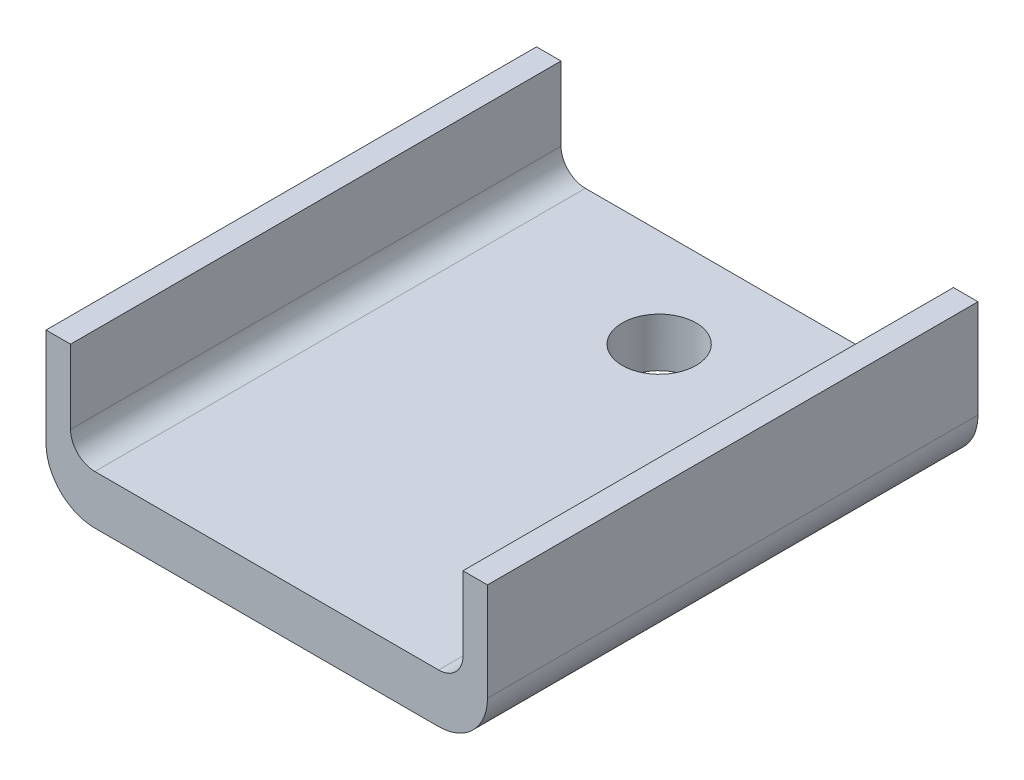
ISO-10303-21;
HEADER;
FILE_DESCRIPTION(('STEP AP214'),'2;1');
FILE_NAME('part.step','',(''),(''),'','','');
FILE_SCHEMA(('AUTOMOTIVE_DESIGN { 1 0 10303 214 1 1 1 1 }'));
ENDSEC;
DATA;
#1=APPLICATION_CONTEXT('core data for automotive mechanical design processes');
#2=APPLICATION_PROTOCOL_DEFINITION('international standard','automotive_design',2000,#1);
#3=PRODUCT_CONTEXT('',#1,'mechanical');
#4=PRODUCT('Part','Part','',(#3));
#5=PRODUCT_RELATED_PRODUCT_CATEGORY('part','',(#4));
#6=PRODUCT_DEFINITION_FORMATION('','',#4);
#7=PRODUCT_DEFINITION_CONTEXT('part definition',#1,'design');
#8=PRODUCT_DEFINITION('design','',#6,#7);
#9=PRODUCT_DEFINITION_SHAPE('','',#8);
#10=(LENGTH_UNIT() NAMED_UNIT(*) SI_UNIT(.MILLI.,.METRE.));
#11=(NAMED_UNIT(*) PLANE_ANGLE_UNIT() SI_UNIT($,.RADIAN.));
#12=(NAMED_UNIT(*) SI_UNIT($,.STERADIAN.) SOLID_ANGLE_UNIT());
#13=UNCERTAINTY_MEASURE_WITH_UNIT(LENGTH_MEASURE(1.E-05),#10,'distance_accuracy_value','');
#14=(GEOMETRIC_REPRESENTATION_CONTEXT(3) GLOBAL_UNCERTAINTY_ASSIGNED_CONTEXT((#13)) GLOBAL_UNIT_ASSIGNED_CONTEXT((#10,
#11,#12)) REPRESENTATION_CONTEXT('',''));
#15=CARTESIAN_POINT('',(0.,0.,0.));
#16=DIRECTION('',(0.,0.,1.));
#17=DIRECTION('',(1.,0.,0.));
#18=AXIS2_PLACEMENT_3D('',#15,#16,#17);
#19=CARTESIAN_POINT('',(-12.7,6.35,15.875));
#20=DIRECTION('',(-1.,0.,0.));
#21=DIRECTION('',(0.,0.,1.));
#22=AXIS2_PLACEMENT_3D('',#19,#20,#21);
#23=PLANE('',#22);
#24=DIRECTION('',(0.,1.,0.));
#25=VECTOR('',#24,1.);
#26=CARTESIAN_POINT('',(-12.7,6.35,15.875));
#27=LINE('',#26,#25);
#28=CARTESIAN_POINT('',(-12.7,1.5748,15.875));
#29=VERTEX_POINT('',#28);
#30=CARTESIAN_POINT('',(-12.7,6.35,15.875));
#31=VERTEX_POINT('',#30);
#32=EDGE_CURVE('E118',#29,#31,#27,.T.);
#33=ORIENTED_EDGE('',*,*,#32,.F.);
#34=DIRECTION('',(0.,0.,-1.));
#35=VECTOR('',#34,1.);
#36=CARTESIAN_POINT('',(-12.7,1.5748,-15.875));
#37=LINE('',#36,#35);
#38=CARTESIAN_POINT('',(-12.7,1.5748,-15.875));
#39=VERTEX_POINT('',#38);
#40=EDGE_CURVE('E206',#29,#39,#37,.T.);
#41=ORIENTED_EDGE('',*,*,#40,.T.);
#42=DIRECTION('',(0.,1.,0.));
#43=VECTOR('',#42,1.);
#44=CARTESIAN_POINT('',(-12.7,6.35,-15.875));
#45=LINE('',#44,#43);
#46=CARTESIAN_POINT('',(-12.7,6.35,-15.875));
#47=VERTEX_POINT('',#46);
#48=EDGE_CURVE('E131',#39,#47,#45,.T.);
#49=ORIENTED_EDGE('',*,*,#48,.T.);
#50=DIRECTION('',(0.,0.,-1.));
#51=VECTOR('',#50,1.);
#52=CARTESIAN_POINT('',(-12.7,6.35,15.875));
#53=LINE('',#52,#51);
#54=EDGE_CURVE('E129',#31,#47,#53,.T.);
#55=ORIENTED_EDGE('',*,*,#54,.F.);
#56=EDGE_LOOP('',(#33,#41,#49,#55));
#57=FACE_BOUND('',#56,.T.);
#58=ADVANCED_FACE('F33',(#57),#23,.F.);
#59=CARTESIAN_POINT('',(-14.2875,6.35,15.875));
#60=DIRECTION('',(0.,-1.,0.));
#61=DIRECTION('',(0.,0.,-1.));
#62=AXIS2_PLACEMENT_3D('',#59,#60,#61);
#63=PLANE('',#62);
#64=DIRECTION('',(-1.,0.,0.));
#65=VECTOR('',#64,1.);
#66=CARTESIAN_POINT('',(-14.2875,6.35,-15.875));
#67=LINE('',#66,#65);
#68=CARTESIAN_POINT('',(-14.2875,6.35,-15.875));
#69=VERTEX_POINT('',#68);
#70=EDGE_CURVE('E157',#47,#69,#67,.T.);
#71=ORIENTED_EDGE('',*,*,#70,.T.);
#72=DIRECTION('',(0.,0.,-1.));
#73=VECTOR('',#72,1.);
#74=CARTESIAN_POINT('',(-14.2875,6.35,15.875));
#75=LINE('',#74,#73);
#76=CARTESIAN_POINT('',(-14.2875,6.35,15.875));
#77=VERTEX_POINT('',#76);
#78=EDGE_CURVE('E135',#77,#69,#75,.T.);
#79=ORIENTED_EDGE('',*,*,#78,.F.);
#80=DIRECTION('',(-1.,0.,0.));
#81=VECTOR('',#80,1.);
#82=CARTESIAN_POINT('',(-14.2875,6.35,15.875));
#83=LINE('',#82,#81);
#84=EDGE_CURVE('E123',#31,#77,#83,.T.);
#85=ORIENTED_EDGE('',*,*,#84,.F.);
#86=ORIENTED_EDGE('',*,*,#54,.T.);
#87=EDGE_LOOP('',(#71,#79,#85,#86));
#88=FACE_BOUND('',#87,.T.);
#89=ADVANCED_FACE('F137',(#88),#63,.F.);
#90=CARTESIAN_POINT('',(-14.2875,-3.175,15.875));
#91=DIRECTION('',(1.,0.,0.));
#92=DIRECTION('',(0.,0.,-1.));
#93=AXIS2_PLACEMENT_3D('',#90,#91,#92);
#94=PLANE('',#93);
#95=DIRECTION('',(0.,-1.,0.));
#96=VECTOR('',#95,1.);
#97=CARTESIAN_POINT('',(-14.2875,-3.175,-15.875));
#98=LINE('',#97,#96);
#99=CARTESIAN_POINT('',(-14.2875,0.,-15.875));
#100=VERTEX_POINT('',#99);
#101=EDGE_CURVE('E160',#69,#100,#98,.T.);
#102=ORIENTED_EDGE('',*,*,#101,.T.);
#103=DIRECTION('',(0.,0.,-1.));
#104=VECTOR('',#103,1.);
#105=CARTESIAN_POINT('',(-14.2875,0.,15.875));
#106=LINE('',#105,#104);
#107=CARTESIAN_POINT('',(-14.2875,0.,15.875));
#108=VERTEX_POINT('',#107);
#109=EDGE_CURVE('E190',#100,#108,#106,.F.);
#110=ORIENTED_EDGE('',*,*,#109,.T.);
#111=DIRECTION('',(0.,-1.,0.));
#112=VECTOR('',#111,1.);
#113=CARTESIAN_POINT('',(-14.2875,-3.175,15.875));
#114=LINE('',#113,#112);
#115=EDGE_CURVE('E140',#77,#108,#114,.T.);
#116=ORIENTED_EDGE('',*,*,#115,.F.);
#117=ORIENTED_EDGE('',*,*,#78,.T.);
#118=EDGE_LOOP('',(#102,#110,#116,#117));
#119=FACE_BOUND('',#118,.T.);
#120=ADVANCED_FACE('F231',(#119),#94,.F.);
#121=CARTESIAN_POINT('',(14.2875,-3.175,15.875));
#122=DIRECTION('',(0.,1.,0.));
#123=DIRECTION('',(-1.,0.,0.));
#124=AXIS2_PLACEMENT_3D('',#121,#122,#123);
#125=PLANE('',#124);
#126=CARTESIAN_POINT('',(0.,-3.175,-9.525));
#127=DIRECTION('',(0.,1.,0.));
#128=DIRECTION('',(-1.,0.,0.));
#129=AXIS2_PLACEMENT_3D('',#126,#127,#128);
#130=CIRCLE('',#129,2.3876);
#131=CARTESIAN_POINT('',(-2.3876,-3.175,-9.525));
#132=VERTEX_POINT('',#131);
#133=EDGE_CURVE('E158',#132,#132,#130,.T.);
#134=ORIENTED_EDGE('',*,*,#133,.T.);
#135=EDGE_LOOP('',(#134));
#136=FACE_BOUND('',#135,.T.);
#137=DIRECTION('',(1.,0.,0.));
#138=VECTOR('',#137,1.);
#139=CARTESIAN_POINT('',(14.2875,-3.175,15.875));
#140=LINE('',#139,#138);
#141=CARTESIAN_POINT('',(-11.1125,-3.175,15.875));
#142=VERTEX_POINT('',#141);
#143=CARTESIAN_POINT('',(11.1125,-3.175,15.875));
#144=VERTEX_POINT('',#143);
#145=EDGE_CURVE('E142',#142,#144,#140,.T.);
#146=ORIENTED_EDGE('',*,*,#145,.F.);
#147=DIRECTION('',(0.,0.,-1.));
#148=VECTOR('',#147,1.);
#149=CARTESIAN_POINT('',(-11.1125,-3.175,15.875));
#150=LINE('',#149,#148);
#151=CARTESIAN_POINT('',(-11.1125,-3.175,-15.875));
#152=VERTEX_POINT('',#151);
#153=EDGE_CURVE('E183',#142,#152,#150,.T.);
#154=ORIENTED_EDGE('',*,*,#153,.T.);
#155=DIRECTION('',(1.,0.,0.));
#156=VECTOR('',#155,1.);
#157=CARTESIAN_POINT('',(14.2875,-3.175,-15.875));
#158=LINE('',#157,#156);
#159=CARTESIAN_POINT('',(11.1125,-3.175,-15.875));
#160=VERTEX_POINT('',#159);
#161=EDGE_CURVE('E163',#152,#160,#158,.T.);
#162=ORIENTED_EDGE('',*,*,#161,.T.);
#163=DIRECTION('',(0.,0.,-1.));
#164=VECTOR('',#163,1.);
#165=CARTESIAN_POINT('',(11.1125,-3.175,15.875));
#166=LINE('',#165,#164);
#167=EDGE_CURVE('E134',#160,#144,#166,.F.);
#168=ORIENTED_EDGE('',*,*,#167,.T.);
#169=EDGE_LOOP('',(#146,#154,#162,#168));
#170=FACE_BOUND('',#169,.T.);
#171=ADVANCED_FACE('F277',(#136,#170),#125,.F.);
#172=CARTESIAN_POINT('',(14.2875,6.35,15.875));
#173=DIRECTION('',(-1.,0.,0.));
#174=DIRECTION('',(0.,-1.,0.));
#175=AXIS2_PLACEMENT_3D('',#172,#173,#174);
#176=PLANE('',#175);
#177=DIRECTION('',(0.,1.,0.));
#178=VECTOR('',#177,1.);
#179=CARTESIAN_POINT('',(14.2875,6.35,15.875));
#180=LINE('',#179,#178);
#181=CARTESIAN_POINT('',(14.2875,0.,15.875));
#182=VERTEX_POINT('',#181);
#183=CARTESIAN_POINT('',(14.2875,6.35,15.875));
#184=VERTEX_POINT('',#183);
#185=EDGE_CURVE('E148',#182,#184,#180,.T.);
#186=ORIENTED_EDGE('',*,*,#185,.F.);
#187=DIRECTION('',(0.,0.,-1.));
#188=VECTOR('',#187,1.);
#189=CARTESIAN_POINT('',(14.2875,0.,15.875));
#190=LINE('',#189,#188);
#191=CARTESIAN_POINT('',(14.2875,0.,-15.875));
#192=VERTEX_POINT('',#191);
#193=EDGE_CURVE('E196',#182,#192,#190,.T.);
#194=ORIENTED_EDGE('',*,*,#193,.T.);
#195=DIRECTION('',(0.,1.,0.));
#196=VECTOR('',#195,1.);
#197=CARTESIAN_POINT('',(14.2875,6.35,-15.875));
#198=LINE('',#197,#196);
#199=CARTESIAN_POINT('',(14.2875,6.35,-15.875));
#200=VERTEX_POINT('',#199);
#201=EDGE_CURVE('E166',#192,#200,#198,.T.);
#202=ORIENTED_EDGE('',*,*,#201,.T.);
#203=DIRECTION('',(0.,0.,-1.));
#204=VECTOR('',#203,1.);
#205=CARTESIAN_POINT('',(14.2875,6.35,15.875));
#206=LINE('',#205,#204);
#207=EDGE_CURVE('E178',#184,#200,#206,.T.);
#208=ORIENTED_EDGE('',*,*,#207,.F.);
#209=EDGE_LOOP('',(#186,#194,#202,#208));
#210=FACE_BOUND('',#209,.T.);
#211=ADVANCED_FACE('F251',(#210),#176,.F.);
#212=CARTESIAN_POINT('',(12.7,6.35,15.875));
#213=DIRECTION('',(0.,-1.,0.));
#214=DIRECTION('',(1.,0.,0.));
#215=AXIS2_PLACEMENT_3D('',#212,#213,#214);
#216=PLANE('',#215);
#217=DIRECTION('',(-1.,0.,0.));
#218=VECTOR('',#217,1.);
#219=CARTESIAN_POINT('',(12.7,6.35,-15.875));
#220=LINE('',#219,#218);
#221=CARTESIAN_POINT('',(12.7,6.35,-15.875));
#222=VERTEX_POINT('',#221);
#223=EDGE_CURVE('E168',#200,#222,#220,.T.);
#224=ORIENTED_EDGE('',*,*,#223,.T.);
#225=DIRECTION('',(0.,0.,-1.));
#226=VECTOR('',#225,1.);
#227=CARTESIAN_POINT('',(12.7,6.35,15.875));
#228=LINE('',#227,#226);
#229=CARTESIAN_POINT('',(12.7,6.35,15.875));
#230=VERTEX_POINT('',#229);
#231=EDGE_CURVE('E155',#230,#222,#228,.T.);
#232=ORIENTED_EDGE('',*,*,#231,.F.);
#233=DIRECTION('',(-1.,0.,0.));
#234=VECTOR('',#233,1.);
#235=CARTESIAN_POINT('',(12.7,6.35,15.875));
#236=LINE('',#235,#234);
#237=EDGE_CURVE('E150',#184,#230,#236,.T.);
#238=ORIENTED_EDGE('',*,*,#237,.F.);
#239=ORIENTED_EDGE('',*,*,#207,.T.);
#240=EDGE_LOOP('',(#224,#232,#238,#239));
#241=FACE_BOUND('',#240,.T.);
#242=ADVANCED_FACE('F257',(#241),#216,.F.);
#243=CARTESIAN_POINT('',(12.7,0.,15.875));
#244=DIRECTION('',(1.,0.,0.));
#245=DIRECTION('',(0.,0.,-1.));
#246=AXIS2_PLACEMENT_3D('',#243,#244,#245);
#247=PLANE('',#246);
#248=DIRECTION('',(0.,-1.,0.));
#249=VECTOR('',#248,1.);
#250=CARTESIAN_POINT('',(12.7,0.,-15.875));
#251=LINE('',#250,#249);
#252=CARTESIAN_POINT('',(12.7,1.5748,-15.875));
#253=VERTEX_POINT('',#252);
#254=EDGE_CURVE('E170',#222,#253,#251,.T.);
#255=ORIENTED_EDGE('',*,*,#254,.T.);
#256=DIRECTION('',(0.,0.,-1.));
#257=VECTOR('',#256,1.);
#258=CARTESIAN_POINT('',(12.7,1.5748,15.875));
#259=LINE('',#258,#257);
#260=CARTESIAN_POINT('',(12.7,1.5748,15.875));
#261=VERTEX_POINT('',#260);
#262=EDGE_CURVE('E204',#253,#261,#259,.F.);
#263=ORIENTED_EDGE('',*,*,#262,.T.);
#264=DIRECTION('',(0.,-1.,0.));
#265=VECTOR('',#264,1.);
#266=CARTESIAN_POINT('',(12.7,0.,15.875));
#267=LINE('',#266,#265);
#268=EDGE_CURVE('E152',#230,#261,#267,.T.);
#269=ORIENTED_EDGE('',*,*,#268,.F.);
#270=ORIENTED_EDGE('',*,*,#231,.T.);
#271=EDGE_LOOP('',(#255,#263,#269,#270));
#272=FACE_BOUND('',#271,.T.);
#273=ADVANCED_FACE('F263',(#272),#247,.F.);
#274=CARTESIAN_POINT('',(0.,0.,15.875));
#275=DIRECTION('',(0.,-1.,0.));
#276=DIRECTION('',(0.,0.,-1.));
#277=AXIS2_PLACEMENT_3D('',#274,#275,#276);
#278=PLANE('',#277);
#279=CARTESIAN_POINT('',(0.,0.,-9.525));
#280=DIRECTION('',(0.,1.,0.));
#281=DIRECTION('',(0.,0.,1.));
#282=AXIS2_PLACEMENT_3D('',#279,#280,#281);
#283=CIRCLE('',#282,2.3876);
#284=CARTESIAN_POINT('',(0.,0.,-7.1374));
#285=VERTEX_POINT('',#284);
#286=EDGE_CURVE('E381',#285,#285,#283,.T.);
#287=ORIENTED_EDGE('',*,*,#286,.F.);
#288=EDGE_LOOP('',(#287));
#289=FACE_BOUND('',#288,.T.);
#290=DIRECTION('',(-1.,0.,0.));
#291=VECTOR('',#290,1.);
#292=CARTESIAN_POINT('',(-12.7,0.,15.875));
#293=LINE('',#292,#291);
#294=CARTESIAN_POINT('',(11.1252,0.,15.875));
#295=VERTEX_POINT('',#294);
#296=CARTESIAN_POINT('',(-11.1252,0.,15.875));
#297=VERTEX_POINT('',#296);
#298=EDGE_CURVE('E126',#295,#297,#293,.T.);
#299=ORIENTED_EDGE('',*,*,#298,.F.);
#300=DIRECTION('',(0.,0.,-1.));
#301=VECTOR('',#300,1.);
#302=CARTESIAN_POINT('',(11.1252,0.,-15.875));
#303=LINE('',#302,#301);
#304=CARTESIAN_POINT('',(11.1252,0.,-15.875));
#305=VERTEX_POINT('',#304);
#306=EDGE_CURVE('E201',#295,#305,#303,.T.);
#307=ORIENTED_EDGE('',*,*,#306,.T.);
#308=DIRECTION('',(-1.,0.,0.));
#309=VECTOR('',#308,1.);
#310=CARTESIAN_POINT('',(0.,0.,-15.875));
#311=LINE('',#310,#309);
#312=CARTESIAN_POINT('',(-11.1252,0.,-15.875));
#313=VERTEX_POINT('',#312);
#314=EDGE_CURVE('E173',#305,#313,#311,.T.);
#315=ORIENTED_EDGE('',*,*,#314,.T.);
#316=DIRECTION('',(0.,0.,-1.));
#317=VECTOR('',#316,1.);
#318=CARTESIAN_POINT('',(-11.1252,0.,15.875));
#319=LINE('',#318,#317);
#320=EDGE_CURVE('E199',#313,#297,#319,.F.);
#321=ORIENTED_EDGE('',*,*,#320,.T.);
#322=EDGE_LOOP('',(#299,#307,#315,#321));
#323=FACE_BOUND('',#322,.T.);
#324=ADVANCED_FACE('F217',(#289,#323),#278,.F.);
#325=CARTESIAN_POINT('',(0.,0.,15.875));
#326=DIRECTION('',(0.,0.,1.));
#327=DIRECTION('',(1.,0.,0.));
#328=AXIS2_PLACEMENT_3D('',#325,#326,#327);
#329=PLANE('',#328);
#330=ORIENTED_EDGE('',*,*,#115,.T.);
#331=CARTESIAN_POINT('',(-11.1125,0.,15.875));
#332=DIRECTION('',(0.,0.,1.));
#333=DIRECTION('',(1.,0.,0.));
#334=AXIS2_PLACEMENT_3D('',#331,#332,#333);
#335=CIRCLE('',#334,3.175);
#336=EDGE_CURVE('E194',#108,#142,#335,.T.);
#337=ORIENTED_EDGE('',*,*,#336,.T.);
#338=ORIENTED_EDGE('',*,*,#145,.T.);
#339=CARTESIAN_POINT('',(11.1125,0.,15.875));
#340=DIRECTION('',(0.,0.,1.));
#341=DIRECTION('',(1.,0.,0.));
#342=AXIS2_PLACEMENT_3D('',#339,#340,#341);
#343=CIRCLE('',#342,3.175);
#344=EDGE_CURVE('E192',#144,#182,#343,.T.);
#345=ORIENTED_EDGE('',*,*,#344,.T.);
#346=ORIENTED_EDGE('',*,*,#185,.T.);
#347=ORIENTED_EDGE('',*,*,#237,.T.);
#348=ORIENTED_EDGE('',*,*,#268,.T.);
#349=CARTESIAN_POINT('',(11.1252,1.5748,15.875));
#350=DIRECTION('',(0.,0.,1.));
#351=DIRECTION('',(1.,0.,0.));
#352=AXIS2_PLACEMENT_3D('',#349,#350,#351);
#353=CIRCLE('',#352,1.5748);
#354=EDGE_CURVE('E210',#261,#295,#353,.F.);
#355=ORIENTED_EDGE('',*,*,#354,.T.);
#356=ORIENTED_EDGE('',*,*,#298,.T.);
#357=CARTESIAN_POINT('',(-11.1252,1.5748,15.875));
#358=DIRECTION('',(0.,0.,1.));
#359=DIRECTION('',(1.,0.,0.));
#360=AXIS2_PLACEMENT_3D('',#357,#358,#359);
#361=CIRCLE('',#360,1.5748);
#362=EDGE_CURVE('E11',#297,#29,#361,.F.);
#363=ORIENTED_EDGE('',*,*,#362,.T.);
#364=ORIENTED_EDGE('',*,*,#32,.T.);
#365=ORIENTED_EDGE('',*,*,#84,.T.);
#366=EDGE_LOOP('',(#330,#337,#338,#345,#346,#347,#348,#355,#356,#363,#364,#365));
#367=FACE_BOUND('',#366,.T.);
#368=ADVANCED_FACE('F121',(#367),#329,.T.);
#369=CARTESIAN_POINT('',(0.,0.,-15.875));
#370=DIRECTION('',(0.,0.,1.));
#371=DIRECTION('',(1.,0.,0.));
#372=AXIS2_PLACEMENT_3D('',#369,#370,#371);
#373=PLANE('',#372);
#374=ORIENTED_EDGE('',*,*,#161,.F.);
#375=CARTESIAN_POINT('',(-11.1125,0.,-15.875));
#376=DIRECTION('',(0.,0.,1.));
#377=DIRECTION('',(1.,0.,0.));
#378=AXIS2_PLACEMENT_3D('',#375,#376,#377);
#379=CIRCLE('',#378,3.175);
#380=EDGE_CURVE('E188',#152,#100,#379,.F.);
#381=ORIENTED_EDGE('',*,*,#380,.T.);
#382=ORIENTED_EDGE('',*,*,#101,.F.);
#383=ORIENTED_EDGE('',*,*,#70,.F.);
#384=ORIENTED_EDGE('',*,*,#48,.F.);
#385=CARTESIAN_POINT('',(-11.1252,1.5748,-15.875));
#386=DIRECTION('',(0.,0.,1.));
#387=DIRECTION('',(1.,0.,0.));
#388=AXIS2_PLACEMENT_3D('',#385,#386,#387);
#389=CIRCLE('',#388,1.5748);
#390=EDGE_CURVE('E41',#39,#313,#389,.T.);
#391=ORIENTED_EDGE('',*,*,#390,.T.);
#392=ORIENTED_EDGE('',*,*,#314,.F.);
#393=CARTESIAN_POINT('',(11.1252,1.5748,-15.875));
#394=DIRECTION('',(0.,0.,1.));
#395=DIRECTION('',(1.,0.,0.));
#396=AXIS2_PLACEMENT_3D('',#393,#394,#395);
#397=CIRCLE('',#396,1.5748);
#398=EDGE_CURVE('E208',#305,#253,#397,.T.);
#399=ORIENTED_EDGE('',*,*,#398,.T.);
#400=ORIENTED_EDGE('',*,*,#254,.F.);
#401=ORIENTED_EDGE('',*,*,#223,.F.);
#402=ORIENTED_EDGE('',*,*,#201,.F.);
#403=CARTESIAN_POINT('',(11.1125,0.,-15.875));
#404=DIRECTION('',(0.,0.,1.));
#405=DIRECTION('',(1.,0.,0.));
#406=AXIS2_PLACEMENT_3D('',#403,#404,#405);
#407=CIRCLE('',#406,3.175);
#408=EDGE_CURVE('E186',#192,#160,#407,.F.);
#409=ORIENTED_EDGE('',*,*,#408,.T.);
#410=EDGE_LOOP('',(#374,#381,#382,#383,#384,#391,#392,#399,#400,#401,#402,#409));
#411=FACE_BOUND('',#410,.T.);
#412=ADVANCED_FACE('F214',(#411),#373,.F.);
#413=CARTESIAN_POINT('',(0.,-12.7,-9.525));
#414=DIRECTION('',(0.,1.,0.));
#415=DIRECTION('',(0.,0.,1.));
#416=AXIS2_PLACEMENT_3D('',#413,#414,#415);
#417=CYLINDRICAL_SURFACE('',#416,2.3876);
#418=ORIENTED_EDGE('',*,*,#286,.T.);
#419=EDGE_LOOP('',(#418));
#420=FACE_BOUND('',#419,.T.);
#421=ORIENTED_EDGE('',*,*,#133,.F.);
#422=EDGE_LOOP('',(#421));
#423=FACE_BOUND('',#422,.T.);
#424=ADVANCED_FACE('F238',(#420,#423),#417,.F.);
#425=CARTESIAN_POINT('',(-11.1125,0.,15.875));
#426=DIRECTION('',(0.,0.,-1.));
#427=DIRECTION('',(-1.,0.,0.));
#428=AXIS2_PLACEMENT_3D('',#425,#426,#427);
#429=CYLINDRICAL_SURFACE('',#428,3.175);
#430=ORIENTED_EDGE('',*,*,#336,.F.);
#431=ORIENTED_EDGE('',*,*,#109,.F.);
#432=ORIENTED_EDGE('',*,*,#380,.F.);
#433=ORIENTED_EDGE('',*,*,#153,.F.);
#434=EDGE_LOOP('',(#430,#431,#432,#433));
#435=FACE_BOUND('',#434,.T.);
#436=ADVANCED_FACE('F235',(#435),#429,.T.);
#437=CARTESIAN_POINT('',(11.1125,0.,15.875));
#438=DIRECTION('',(0.,0.,-1.));
#439=DIRECTION('',(-1.,0.,0.));
#440=AXIS2_PLACEMENT_3D('',#437,#438,#439);
#441=CYLINDRICAL_SURFACE('',#440,3.175);
#442=ORIENTED_EDGE('',*,*,#344,.F.);
#443=ORIENTED_EDGE('',*,*,#167,.F.);
#444=ORIENTED_EDGE('',*,*,#408,.F.);
#445=ORIENTED_EDGE('',*,*,#193,.F.);
#446=EDGE_LOOP('',(#442,#443,#444,#445));
#447=FACE_BOUND('',#446,.T.);
#448=ADVANCED_FACE('F224',(#447),#441,.T.);
#449=CARTESIAN_POINT('',(11.1252,1.5748,15.875));
#450=DIRECTION('',(0.,0.,1.));
#451=DIRECTION('',(1.,0.,0.));
#452=AXIS2_PLACEMENT_3D('',#449,#450,#451);
#453=CYLINDRICAL_SURFACE('',#452,1.5748);
#454=ORIENTED_EDGE('',*,*,#354,.F.);
#455=ORIENTED_EDGE('',*,*,#262,.F.);
#456=ORIENTED_EDGE('',*,*,#398,.F.);
#457=ORIENTED_EDGE('',*,*,#306,.F.);
#458=EDGE_LOOP('',(#454,#455,#456,#457));
#459=FACE_BOUND('',#458,.T.);
#460=ADVANCED_FACE('F220',(#459),#453,.F.);
#461=CARTESIAN_POINT('',(-11.1252,1.5748,15.875));
#462=DIRECTION('',(0.,0.,1.));
#463=DIRECTION('',(1.,0.,0.));
#464=AXIS2_PLACEMENT_3D('',#461,#462,#463);
#465=CYLINDRICAL_SURFACE('',#464,1.5748);
#466=ORIENTED_EDGE('',*,*,#362,.F.);
#467=ORIENTED_EDGE('',*,*,#320,.F.);
#468=ORIENTED_EDGE('',*,*,#390,.F.);
#469=ORIENTED_EDGE('',*,*,#40,.F.);
#470=EDGE_LOOP('',(#466,#467,#468,#469));
#471=FACE_BOUND('',#470,.T.);
#472=ADVANCED_FACE('F35',(#471),#465,.F.);
#473=CLOSED_SHELL('',(#58,#89,#120,#171,#211,#242,#273,#324,#368,#412,#424,#436,#448,#460,#472));
#474=MANIFOLD_SOLID_BREP('B2',#473);
#475=ADVANCED_BREP_SHAPE_REPRESENTATION('',(#18,#474),#14);
#476=SHAPE_DEFINITION_REPRESENTATION(#9,#475);
ENDSEC;
END-ISO-10303-21;
